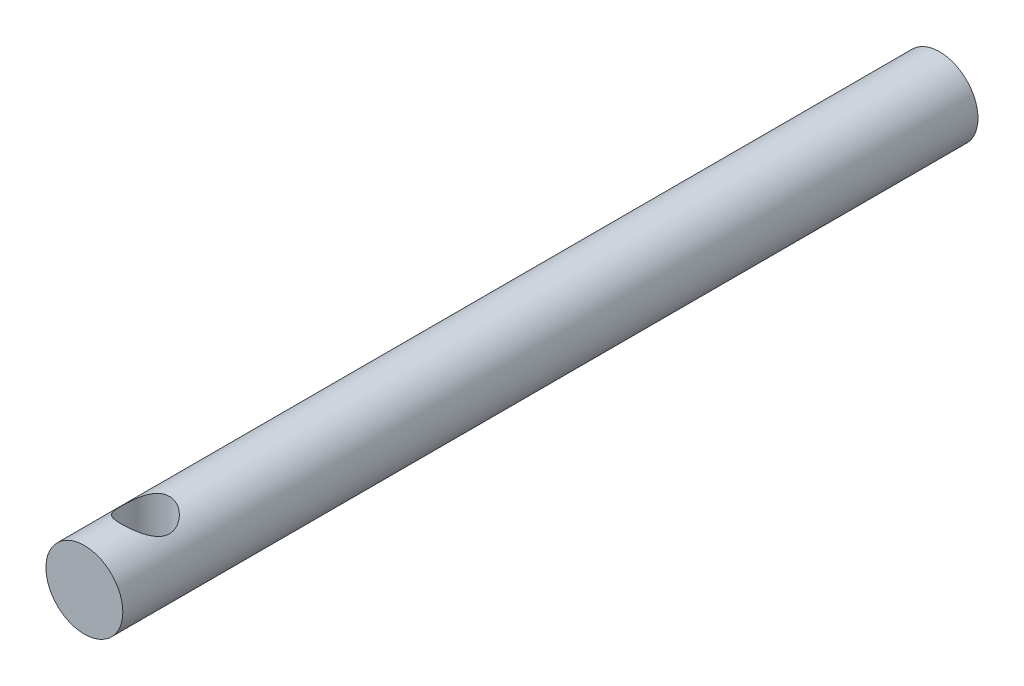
ISO-10303-21;
HEADER;
FILE_DESCRIPTION(('STEP AP214'),'2;1');
FILE_NAME('part.step','',(''),(''),'','','');
FILE_SCHEMA(('AUTOMOTIVE_DESIGN { 1 0 10303 214 1 1 1 1 }'));
ENDSEC;
DATA;
#1=APPLICATION_CONTEXT('core data for automotive mechanical design processes');
#2=APPLICATION_PROTOCOL_DEFINITION('international standard','automotive_design',2000,#1);
#3=PRODUCT_CONTEXT('',#1,'mechanical');
#4=PRODUCT('Part','Part','',(#3));
#5=PRODUCT_RELATED_PRODUCT_CATEGORY('part','',(#4));
#6=PRODUCT_DEFINITION_FORMATION('','',#4);
#7=PRODUCT_DEFINITION_CONTEXT('part definition',#1,'design');
#8=PRODUCT_DEFINITION('design','',#6,#7);
#9=PRODUCT_DEFINITION_SHAPE('','',#8);
#10=(LENGTH_UNIT() NAMED_UNIT(*) SI_UNIT(.MILLI.,.METRE.));
#11=(NAMED_UNIT(*) PLANE_ANGLE_UNIT() SI_UNIT($,.RADIAN.));
#12=(NAMED_UNIT(*) SI_UNIT($,.STERADIAN.) SOLID_ANGLE_UNIT());
#13=UNCERTAINTY_MEASURE_WITH_UNIT(LENGTH_MEASURE(1.E-05),#10,'distance_accuracy_value','');
#14=(GEOMETRIC_REPRESENTATION_CONTEXT(3) GLOBAL_UNCERTAINTY_ASSIGNED_CONTEXT((#13)) GLOBAL_UNIT_ASSIGNED_CONTEXT((#10,
#11,#12)) REPRESENTATION_CONTEXT('',''));
#15=CARTESIAN_POINT('',(0.,0.,0.));
#16=DIRECTION('',(0.,0.,1.));
#17=DIRECTION('',(1.,0.,0.));
#18=AXIS2_PLACEMENT_3D('',#15,#16,#17);
#19=CARTESIAN_POINT('',(0.,0.,0.));
#20=DIRECTION('',(0.,0.,1.));
#21=DIRECTION('',(1.,0.,0.));
#22=AXIS2_PLACEMENT_3D('',#19,#20,#21);
#23=PLANE('',#22);
#24=CARTESIAN_POINT('',(0.,0.,0.));
#25=DIRECTION('',(0.,0.,1.));
#26=DIRECTION('',(1.,0.,0.));
#27=AXIS2_PLACEMENT_3D('',#24,#25,#26);
#28=CIRCLE('',#27,4.);
#29=CARTESIAN_POINT('',(4.,0.,0.));
#30=VERTEX_POINT('',#29);
#31=EDGE_CURVE('E44',#30,#30,#28,.T.);
#32=ORIENTED_EDGE('',*,*,#31,.F.);
#33=EDGE_LOOP('',(#32));
#34=FACE_BOUND('',#33,.T.);
#35=CARTESIAN_POINT('',(0.,0.,0.));
#36=DIRECTION('',(0.,0.,-1.));
#37=DIRECTION('',(-1.,0.,0.));
#38=AXIS2_PLACEMENT_3D('',#35,#36,#37);
#39=CIRCLE('',#38,2.99999999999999);
#40=CARTESIAN_POINT('',(-2.99999999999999,0.,0.));
#41=VERTEX_POINT('',#40);
#42=EDGE_CURVE('E59',#41,#41,#39,.T.);
#43=ORIENTED_EDGE('',*,*,#42,.F.);
#44=EDGE_LOOP('',(#43));
#45=FACE_BOUND('',#44,.T.);
#46=ADVANCED_FACE('F32',(#34,#45),#23,.F.);
#47=CARTESIAN_POINT('',(0.,0.,89.));
#48=DIRECTION('',(0.,0.,-1.));
#49=DIRECTION('',(-1.,0.,0.));
#50=AXIS2_PLACEMENT_3D('',#47,#48,#49);
#51=CYLINDRICAL_SURFACE('',#50,4.);
#52=CARTESIAN_POINT('',(0.,-4.,85.15));
#53=CARTESIAN_POINT('',(0.127017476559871,-3.99999041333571,85.1499895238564));
#54=CARTESIAN_POINT('',(0.254191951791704,-3.9938860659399,85.1402535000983));
#55=CARTESIAN_POINT('',(0.504637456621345,-3.97004375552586,85.1018288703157));
#56=CARTESIAN_POINT('',(0.627900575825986,-3.95228361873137,85.0731041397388));
#57=CARTESIAN_POINT('',(0.86641086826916,-3.90691695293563,84.9983771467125));
#58=CARTESIAN_POINT('',(0.981694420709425,-3.87935918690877,84.9524603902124));
#59=CARTESIAN_POINT('',(1.20252080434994,-3.81669199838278,84.8452283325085));
#60=CARTESIAN_POINT('',(1.30806471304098,-3.7815834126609,84.7839147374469));
#61=CARTESIAN_POINT('',(1.51594836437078,-3.70340304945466,84.6422268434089));
#62=CARTESIAN_POINT('',(1.61735911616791,-3.65991924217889,84.5607213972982));
#63=CARTESIAN_POINT('',(1.80597275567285,-3.57062700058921,84.3835616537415));
#64=CARTESIAN_POINT('',(1.89315621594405,-3.52481549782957,84.2878883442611));
#65=CARTESIAN_POINT('',(2.06285746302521,-3.42860837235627,84.0699322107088));
#66=CARTESIAN_POINT('',(2.14314412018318,-3.37843221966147,83.9458004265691));
#67=CARTESIAN_POINT('',(2.28147932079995,-3.28660396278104,83.6828703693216));
#68=CARTESIAN_POINT('',(2.33956541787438,-3.2449375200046,83.544097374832));
#69=CARTESIAN_POINT('',(2.41866801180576,-3.18619151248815,83.2923789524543));
#70=CARTESIAN_POINT('',(2.44539104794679,-3.16553811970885,83.1820663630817));
#71=CARTESIAN_POINT('',(2.4836368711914,-3.1356271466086,82.9573881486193));
#72=CARTESIAN_POINT('',(2.49518112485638,-3.12635347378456,82.8430284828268));
#73=CARTESIAN_POINT('',(2.50237836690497,-3.12059771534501,82.6131739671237));
#74=CARTESIAN_POINT('',(2.49798968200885,-3.12414917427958,82.4976769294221));
#75=CARTESIAN_POINT('',(2.47352633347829,-3.14354804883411,82.2693797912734));
#76=CARTESIAN_POINT('',(2.4534390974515,-3.15940531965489,82.1565819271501));
#77=CARTESIAN_POINT('',(2.39936209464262,-3.20065145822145,81.9391231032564));
#78=CARTESIAN_POINT('',(2.36570043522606,-3.2258142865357,81.8343351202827));
#79=CARTESIAN_POINT('',(2.28580369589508,-3.28291134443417,81.6316776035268));
#80=CARTESIAN_POINT('',(2.23956416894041,-3.31484796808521,81.5338105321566));
#81=CARTESIAN_POINT('',(2.12589830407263,-3.38909625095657,81.3283335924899));
#82=CARTESIAN_POINT('',(2.05612773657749,-3.43223155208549,81.2223189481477));
#83=CARTESIAN_POINT('',(1.9017611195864,-3.52011451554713,81.0223388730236));
#84=CARTESIAN_POINT('',(1.81714983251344,-3.56486379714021,80.9283859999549));
#85=CARTESIAN_POINT('',(1.61904732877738,-3.65959667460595,80.7393989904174));
#86=CARTESIAN_POINT('',(1.50309447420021,-3.70922571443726,80.6467440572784));
#87=CARTESIAN_POINT('',(1.25426444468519,-3.80056601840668,80.482288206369));
#88=CARTESIAN_POINT('',(1.12139395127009,-3.84228039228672,80.4104790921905));
#89=CARTESIAN_POINT('',(0.915775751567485,-3.89435975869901,80.322654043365));
#90=CARTESIAN_POINT('',(0.848193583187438,-3.90966874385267,80.2971657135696));
#91=CARTESIAN_POINT('',(0.71049204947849,-3.93701839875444,80.2519923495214));
#92=CARTESIAN_POINT('',(0.640374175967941,-3.94906095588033,80.2323039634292));
#93=CARTESIAN_POINT('',(0.49823901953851,-3.96949699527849,80.1990658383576));
#94=CARTESIAN_POINT('',(0.426223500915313,-3.97789374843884,80.185510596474));
#95=CARTESIAN_POINT('',(0.280965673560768,-3.9907876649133,80.1647537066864));
#96=CARTESIAN_POINT('',(0.207723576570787,-3.99528549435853,80.1575509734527));
#97=CARTESIAN_POINT('',(0.00911917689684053,-4.00193773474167,80.1468906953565));
#98=CARTESIAN_POINT('',(-0.11678201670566,-4.000238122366,80.1495996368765));
#99=CARTESIAN_POINT('',(-0.365967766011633,-3.98518313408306,80.1737596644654));
#100=CARTESIAN_POINT('',(-0.489252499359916,-3.97182855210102,80.1952094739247));
#101=CARTESIAN_POINT('',(-0.725036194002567,-3.9354797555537,80.2544785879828));
#102=CARTESIAN_POINT('',(-0.837768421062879,-3.91288306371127,80.2916247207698));
#103=CARTESIAN_POINT('',(-1.05527816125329,-3.85991402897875,80.3805923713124));
#104=CARTESIAN_POINT('',(-1.16005433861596,-3.82954038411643,80.4324163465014));
#105=CARTESIAN_POINT('',(-1.37016761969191,-3.75980014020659,80.5550305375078));
#106=CARTESIAN_POINT('',(-1.47449380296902,-3.71983526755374,80.627207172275));
#107=CARTESIAN_POINT('',(-1.6702854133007,-3.63613942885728,80.7855876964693));
#108=CARTESIAN_POINT('',(-1.76173634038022,-3.59240430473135,80.8718071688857));
#109=CARTESIAN_POINT('',(-1.94294835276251,-3.4981173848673,81.0702700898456));
#110=CARTESIAN_POINT('',(-2.03053702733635,-3.44749766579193,81.1844744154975));
#111=CARTESIAN_POINT('',(-2.18560704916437,-3.35133525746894,81.4277515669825));
#112=CARTESIAN_POINT('',(-2.25310231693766,-3.3057890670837,81.5568140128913));
#113=CARTESIAN_POINT('',(-2.35369543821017,-3.2346706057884,81.7993842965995));
#114=CARTESIAN_POINT('',(-2.39103791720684,-3.20691272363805,81.9104815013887));
#115=CARTESIAN_POINT('',(-2.45000216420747,-3.16210061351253,82.1387862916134));
#116=CARTESIAN_POINT('',(-2.47164849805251,-3.14502966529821,82.2559840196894));
#117=CARTESIAN_POINT('',(-2.49802767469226,-3.124126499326,82.4941805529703));
#118=CARTESIAN_POINT('',(-2.50266374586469,-3.12037003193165,82.6151971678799));
#119=CARTESIAN_POINT('',(-2.49439556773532,-3.12698126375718,82.8562619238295));
#120=CARTESIAN_POINT('',(-2.48148548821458,-3.13735365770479,82.9763097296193));
#121=CARTESIAN_POINT('',(-2.44076547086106,-3.16910777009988,83.2020595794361));
#122=CARTESIAN_POINT('',(-2.41423847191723,-3.18953614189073,83.3081385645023));
#123=CARTESIAN_POINT('',(-2.34835238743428,-3.23835062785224,83.5142701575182));
#124=CARTESIAN_POINT('',(-2.30898795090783,-3.26674005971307,83.6143202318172));
#125=CARTESIAN_POINT('',(-2.21205415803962,-3.3332779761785,83.8211933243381));
#126=CARTESIAN_POINT('',(-2.15267427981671,-3.37224428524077,83.9268999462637));
#127=CARTESIAN_POINT('',(-2.01999894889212,-3.45335445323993,84.1278773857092));
#128=CARTESIAN_POINT('',(-1.9466922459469,-3.49550086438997,84.223139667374));
#129=CARTESIAN_POINT('',(-1.77134669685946,-3.58803675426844,84.4200255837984));
#130=CARTESIAN_POINT('',(-1.66649284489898,-3.63840488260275,84.5191697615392));
#131=CARTESIAN_POINT('',(-1.43961937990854,-3.73398053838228,84.699001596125));
#132=CARTESIAN_POINT('',(-1.31758921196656,-3.77918486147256,84.7796778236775));
#133=CARTESIAN_POINT('',(-1.12346357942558,-3.83959214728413,84.8845634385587));
#134=CARTESIAN_POINT('',(-1.05679601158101,-3.85851834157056,84.916874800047));
#135=CARTESIAN_POINT('',(-0.920199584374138,-3.8933516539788,84.9756722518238));
#136=CARTESIAN_POINT('',(-0.850272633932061,-3.90926051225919,85.0021617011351));
#137=CARTESIAN_POINT('',(-0.707873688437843,-3.93753374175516,85.0488571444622));
#138=CARTESIAN_POINT('',(-0.635409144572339,-3.94990764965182,85.0690800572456));
#139=CARTESIAN_POINT('',(-0.488456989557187,-3.97075677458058,85.1029754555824));
#140=CARTESIAN_POINT('',(-0.413970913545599,-3.97923486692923,85.1166527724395));
#141=CARTESIAN_POINT('',(-0.282852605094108,-3.99038271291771,85.1345904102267));
#142=CARTESIAN_POINT('',(-0.226501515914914,-3.99398159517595,85.1403615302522));
#143=CARTESIAN_POINT('',(-0.113444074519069,-3.99879245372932,85.1480687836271));
#144=CARTESIAN_POINT('',(-0.0567377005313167,-4.00000428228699,85.1500046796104));
#145=CARTESIAN_POINT('',(0.,-4.,85.15));
#146=B_SPLINE_CURVE_WITH_KNOTS('',3,(#52,#53,#54,#55,#56,#57,#58,#59,#60,#61,#62,#63,#64,#65,
#66,#67,#68,#69,#70,#71,#72,#73,#74,#75,#76,#77,#78,#79,#80,#81,#82,#83,#84,#85,#86,#87,#88,#89,
#90,#91,#92,#93,#94,#95,#96,#97,#98,#99,#100,#101,#102,#103,#104,#105,#106,#107,#108,#109,#110,
#111,#112,#113,#114,#115,#116,#117,#118,#119,#120,#121,#122,#123,#124,#125,#126,#127,#128,#129,
#130,#131,#132,#133,#134,#135,#136,#137,#138,#139,#140,#141,#142,#143,#144,#145),.UNSPECIFIED.,
.T.,.F.,(4,2,2,2,2,2,2,2,2,2,2,2,2,2,2,2,2,2,2,2,2,2,2,2,2,2,2,2,2,2,2,2,2,2,2,2,2,2,2,2,2,2,2,
2,2,2,4),(0.,0.380824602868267,0.762375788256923,1.14205397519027,1.52169010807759,
1.93164374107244,2.34215256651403,2.80825951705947,3.27357449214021,3.61824017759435,
3.9624178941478,4.30749646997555,4.65285169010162,4.99031678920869,5.32790135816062,
5.72854900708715,6.12961045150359,6.59684361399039,7.06389281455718,7.28510978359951,
7.50619865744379,7.72708876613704,7.9479411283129,8.32363778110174,8.69930884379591,
9.06028425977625,9.42132014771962,9.81879878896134,10.216721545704,10.6724083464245,
11.1277787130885,11.4876929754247,11.8470427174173,12.2084336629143,12.5699447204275,
12.9023575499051,13.2349091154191,13.6156046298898,13.9966089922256,14.4531049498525,
14.9098826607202,15.138984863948,15.3679545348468,15.5963005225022,15.8244777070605,
15.994578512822,16.1646898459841),.UNSPECIFIED.);
#147=CARTESIAN_POINT('',(0.,-4.,85.15));
#148=VERTEX_POINT('',#147);
#149=EDGE_CURVE('E37',#148,#148,#146,.T.);
#150=ORIENTED_EDGE('',*,*,#149,.T.);
#151=EDGE_LOOP('',(#150));
#152=FACE_BOUND('',#151,.T.);
#153=CARTESIAN_POINT('',(0.,4.,85.15));
#154=CARTESIAN_POINT('',(-0.127017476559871,3.99999041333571,85.1499895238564));
#155=CARTESIAN_POINT('',(-0.254191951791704,3.9938860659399,85.1402535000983));
#156=CARTESIAN_POINT('',(-0.504637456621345,3.97004375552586,85.1018288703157));
#157=CARTESIAN_POINT('',(-0.627900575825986,3.95228361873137,85.0731041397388));
#158=CARTESIAN_POINT('',(-0.86641086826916,3.90691695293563,84.9983771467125));
#159=CARTESIAN_POINT('',(-0.981694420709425,3.87935918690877,84.9524603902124));
#160=CARTESIAN_POINT('',(-1.20252080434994,3.81669199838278,84.8452283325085));
#161=CARTESIAN_POINT('',(-1.30806471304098,3.7815834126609,84.7839147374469));
#162=CARTESIAN_POINT('',(-1.51594836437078,3.70340304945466,84.6422268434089));
#163=CARTESIAN_POINT('',(-1.61735911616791,3.65991924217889,84.5607213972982));
#164=CARTESIAN_POINT('',(-1.80597275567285,3.57062700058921,84.3835616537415));
#165=CARTESIAN_POINT('',(-1.89315621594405,3.52481549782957,84.2878883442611));
#166=CARTESIAN_POINT('',(-2.06285746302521,3.42860837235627,84.0699322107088));
#167=CARTESIAN_POINT('',(-2.14314412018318,3.37843221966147,83.9458004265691));
#168=CARTESIAN_POINT('',(-2.28147932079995,3.28660396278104,83.6828703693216));
#169=CARTESIAN_POINT('',(-2.33956541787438,3.2449375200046,83.544097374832));
#170=CARTESIAN_POINT('',(-2.41866801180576,3.18619151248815,83.2923789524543));
#171=CARTESIAN_POINT('',(-2.44539104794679,3.16553811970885,83.1820663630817));
#172=CARTESIAN_POINT('',(-2.4836368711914,3.1356271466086,82.9573881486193));
#173=CARTESIAN_POINT('',(-2.49518112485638,3.12635347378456,82.8430284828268));
#174=CARTESIAN_POINT('',(-2.50237836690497,3.12059771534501,82.6131739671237));
#175=CARTESIAN_POINT('',(-2.49798968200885,3.12414917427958,82.4976769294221));
#176=CARTESIAN_POINT('',(-2.47352633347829,3.14354804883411,82.2693797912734));
#177=CARTESIAN_POINT('',(-2.4534390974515,3.15940531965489,82.1565819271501));
#178=CARTESIAN_POINT('',(-2.39936209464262,3.20065145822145,81.9391231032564));
#179=CARTESIAN_POINT('',(-2.36570043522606,3.2258142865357,81.8343351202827));
#180=CARTESIAN_POINT('',(-2.28580369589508,3.28291134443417,81.6316776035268));
#181=CARTESIAN_POINT('',(-2.23956416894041,3.31484796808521,81.5338105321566));
#182=CARTESIAN_POINT('',(-2.12589830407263,3.38909625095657,81.3283335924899));
#183=CARTESIAN_POINT('',(-2.05612773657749,3.43223155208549,81.2223189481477));
#184=CARTESIAN_POINT('',(-1.9017611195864,3.52011451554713,81.0223388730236));
#185=CARTESIAN_POINT('',(-1.81714983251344,3.56486379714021,80.9283859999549));
#186=CARTESIAN_POINT('',(-1.61904732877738,3.65959667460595,80.7393989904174));
#187=CARTESIAN_POINT('',(-1.50309447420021,3.70922571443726,80.6467440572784));
#188=CARTESIAN_POINT('',(-1.25426444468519,3.80056601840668,80.482288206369));
#189=CARTESIAN_POINT('',(-1.12139395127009,3.84228039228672,80.4104790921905));
#190=CARTESIAN_POINT('',(-0.915775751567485,3.89435975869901,80.322654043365));
#191=CARTESIAN_POINT('',(-0.848193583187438,3.90966874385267,80.2971657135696));
#192=CARTESIAN_POINT('',(-0.71049204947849,3.93701839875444,80.2519923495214));
#193=CARTESIAN_POINT('',(-0.640374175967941,3.94906095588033,80.2323039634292));
#194=CARTESIAN_POINT('',(-0.49823901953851,3.96949699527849,80.1990658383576));
#195=CARTESIAN_POINT('',(-0.426223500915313,3.97789374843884,80.185510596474));
#196=CARTESIAN_POINT('',(-0.280965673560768,3.9907876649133,80.1647537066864));
#197=CARTESIAN_POINT('',(-0.207723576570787,3.99528549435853,80.1575509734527));
#198=CARTESIAN_POINT('',(-0.00911917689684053,4.00193773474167,80.1468906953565));
#199=CARTESIAN_POINT('',(0.11678201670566,4.000238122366,80.1495996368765));
#200=CARTESIAN_POINT('',(0.365967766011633,3.98518313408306,80.1737596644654));
#201=CARTESIAN_POINT('',(0.489252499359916,3.97182855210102,80.1952094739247));
#202=CARTESIAN_POINT('',(0.725036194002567,3.9354797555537,80.2544785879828));
#203=CARTESIAN_POINT('',(0.837768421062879,3.91288306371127,80.2916247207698));
#204=CARTESIAN_POINT('',(1.05527816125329,3.85991402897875,80.3805923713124));
#205=CARTESIAN_POINT('',(1.16005433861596,3.82954038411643,80.4324163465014));
#206=CARTESIAN_POINT('',(1.37016761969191,3.75980014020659,80.5550305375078));
#207=CARTESIAN_POINT('',(1.47449380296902,3.71983526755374,80.627207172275));
#208=CARTESIAN_POINT('',(1.6702854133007,3.63613942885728,80.7855876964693));
#209=CARTESIAN_POINT('',(1.76173634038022,3.59240430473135,80.8718071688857));
#210=CARTESIAN_POINT('',(1.94294835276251,3.4981173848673,81.0702700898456));
#211=CARTESIAN_POINT('',(2.03053702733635,3.44749766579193,81.1844744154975));
#212=CARTESIAN_POINT('',(2.18560704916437,3.35133525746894,81.4277515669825));
#213=CARTESIAN_POINT('',(2.25310231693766,3.3057890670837,81.5568140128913));
#214=CARTESIAN_POINT('',(2.35369543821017,3.2346706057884,81.7993842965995));
#215=CARTESIAN_POINT('',(2.39103791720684,3.20691272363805,81.9104815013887));
#216=CARTESIAN_POINT('',(2.45000216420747,3.16210061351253,82.1387862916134));
#217=CARTESIAN_POINT('',(2.47164849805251,3.14502966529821,82.2559840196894));
#218=CARTESIAN_POINT('',(2.49802767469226,3.124126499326,82.4941805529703));
#219=CARTESIAN_POINT('',(2.50266374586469,3.12037003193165,82.6151971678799));
#220=CARTESIAN_POINT('',(2.49439556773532,3.12698126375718,82.8562619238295));
#221=CARTESIAN_POINT('',(2.48148548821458,3.13735365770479,82.9763097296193));
#222=CARTESIAN_POINT('',(2.44076547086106,3.16910777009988,83.2020595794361));
#223=CARTESIAN_POINT('',(2.41423847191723,3.18953614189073,83.3081385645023));
#224=CARTESIAN_POINT('',(2.34835238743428,3.23835062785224,83.5142701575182));
#225=CARTESIAN_POINT('',(2.30898795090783,3.26674005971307,83.6143202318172));
#226=CARTESIAN_POINT('',(2.21205415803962,3.3332779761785,83.8211933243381));
#227=CARTESIAN_POINT('',(2.15267427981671,3.37224428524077,83.9268999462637));
#228=CARTESIAN_POINT('',(2.01999894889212,3.45335445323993,84.1278773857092));
#229=CARTESIAN_POINT('',(1.9466922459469,3.49550086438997,84.223139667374));
#230=CARTESIAN_POINT('',(1.77134669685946,3.58803675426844,84.4200255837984));
#231=CARTESIAN_POINT('',(1.66649284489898,3.63840488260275,84.5191697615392));
#232=CARTESIAN_POINT('',(1.43961937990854,3.73398053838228,84.699001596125));
#233=CARTESIAN_POINT('',(1.31758921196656,3.77918486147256,84.7796778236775));
#234=CARTESIAN_POINT('',(1.12346357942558,3.83959214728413,84.8845634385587));
#235=CARTESIAN_POINT('',(1.05679601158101,3.85851834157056,84.916874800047));
#236=CARTESIAN_POINT('',(0.920199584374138,3.8933516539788,84.9756722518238));
#237=CARTESIAN_POINT('',(0.850272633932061,3.90926051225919,85.0021617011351));
#238=CARTESIAN_POINT('',(0.707873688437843,3.93753374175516,85.0488571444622));
#239=CARTESIAN_POINT('',(0.635409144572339,3.94990764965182,85.0690800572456));
#240=CARTESIAN_POINT('',(0.488456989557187,3.97075677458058,85.1029754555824));
#241=CARTESIAN_POINT('',(0.413970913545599,3.97923486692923,85.1166527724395));
#242=CARTESIAN_POINT('',(0.282852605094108,3.99038271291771,85.1345904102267));
#243=CARTESIAN_POINT('',(0.226501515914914,3.99398159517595,85.1403615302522));
#244=CARTESIAN_POINT('',(0.113444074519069,3.99879245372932,85.1480687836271));
#245=CARTESIAN_POINT('',(0.0567377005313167,4.00000428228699,85.1500046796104));
#246=CARTESIAN_POINT('',(0.,4.,85.15));
#247=B_SPLINE_CURVE_WITH_KNOTS('',3,(#153,#154,#155,#156,#157,#158,#159,#160,#161,#162,#163,
#164,#165,#166,#167,#168,#169,#170,#171,#172,#173,#174,#175,#176,#177,#178,#179,#180,#181,#182,
#183,#184,#185,#186,#187,#188,#189,#190,#191,#192,#193,#194,#195,#196,#197,#198,#199,#200,#201,
#202,#203,#204,#205,#206,#207,#208,#209,#210,#211,#212,#213,#214,#215,#216,#217,#218,#219,#220,
#221,#222,#223,#224,#225,#226,#227,#228,#229,#230,#231,#232,#233,#234,#235,#236,#237,#238,#239,
#240,#241,#242,#243,#244,#245,#246),.UNSPECIFIED.,.T.,.F.,(4,2,2,2,2,2,2,2,2,2,2,2,2,2,2,2,2,2,
2,2,2,2,2,2,2,2,2,2,2,2,2,2,2,2,2,2,2,2,2,2,2,2,2,2,2,2,4),(0.,0.380824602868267,
0.762375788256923,1.14205397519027,1.52169010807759,1.93164374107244,2.34215256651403,
2.80825951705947,3.27357449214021,3.61824017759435,3.9624178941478,4.30749646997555,
4.65285169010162,4.99031678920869,5.32790135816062,5.72854900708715,6.12961045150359,
6.59684361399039,7.06389281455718,7.28510978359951,7.50619865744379,7.72708876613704,
7.9479411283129,8.32363778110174,8.69930884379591,9.06028425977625,9.42132014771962,
9.81879878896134,10.216721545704,10.6724083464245,11.1277787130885,11.4876929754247,
11.8470427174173,12.2084336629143,12.5699447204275,12.9023575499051,13.2349091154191,
13.6156046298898,13.9966089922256,14.4531049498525,14.9098826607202,15.138984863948,
15.3679545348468,15.5963005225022,15.8244777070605,15.994578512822,16.1646898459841),.UNSPECIFIED.);
#248=CARTESIAN_POINT('',(0.,4.,85.15));
#249=VERTEX_POINT('',#248);
#250=EDGE_CURVE('E58',#249,#249,#247,.T.);
#251=ORIENTED_EDGE('',*,*,#250,.T.);
#252=EDGE_LOOP('',(#251));
#253=FACE_BOUND('',#252,.T.);
#254=CARTESIAN_POINT('',(0.,0.,89.));
#255=DIRECTION('',(0.,0.,1.));
#256=DIRECTION('',(1.,0.,0.));
#257=AXIS2_PLACEMENT_3D('',#254,#255,#256);
#258=CIRCLE('',#257,4.);
#259=CARTESIAN_POINT('',(4.,0.,89.));
#260=VERTEX_POINT('',#259);
#261=EDGE_CURVE('E11',#260,#260,#258,.T.);
#262=ORIENTED_EDGE('',*,*,#261,.F.);
#263=EDGE_LOOP('',(#262));
#264=FACE_BOUND('',#263,.T.);
#265=ORIENTED_EDGE('',*,*,#31,.T.);
#266=EDGE_LOOP('',(#265));
#267=FACE_BOUND('',#266,.T.);
#268=ADVANCED_FACE('F34',(#152,#253,#264,#267),#51,.T.);
#269=CARTESIAN_POINT('',(0.,0.,89.));
#270=DIRECTION('',(0.,0.,1.));
#271=DIRECTION('',(1.,0.,0.));
#272=AXIS2_PLACEMENT_3D('',#269,#270,#271);
#273=PLANE('',#272);
#274=ORIENTED_EDGE('',*,*,#261,.T.);
#275=EDGE_LOOP('',(#274));
#276=FACE_BOUND('',#275,.T.);
#277=ADVANCED_FACE('F71',(#276),#273,.T.);
#278=CARTESIAN_POINT('',(0.,-44.5,82.65));
#279=DIRECTION('',(0.,1.,0.));
#280=DIRECTION('',(0.,0.,1.));
#281=AXIS2_PLACEMENT_3D('',#278,#279,#280);
#282=CYLINDRICAL_SURFACE('',#281,2.5);
#283=ORIENTED_EDGE('',*,*,#250,.F.);
#284=EDGE_LOOP('',(#283));
#285=FACE_BOUND('',#284,.T.);
#286=ORIENTED_EDGE('',*,*,#149,.F.);
#287=EDGE_LOOP('',(#286));
#288=FACE_BOUND('',#287,.T.);
#289=ADVANCED_FACE('F52',(#285,#288),#282,.F.);
#290=CARTESIAN_POINT('',(0.,0.,30.));
#291=DIRECTION('',(0.,0.,-1.));
#292=DIRECTION('',(-1.,0.,0.));
#293=AXIS2_PLACEMENT_3D('',#290,#291,#292);
#294=CONICAL_SURFACE('',#293,2.99999999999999,1.02974425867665);
#295=CARTESIAN_POINT('',(0.,0.,31.8025818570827));
#296=VERTEX_POINT('',#295);
#297=VERTEX_LOOP('',#296);
#298=FACE_BOUND('',#297,.T.);
#299=CARTESIAN_POINT('',(0.,0.,30.));
#300=DIRECTION('',(0.,0.,-1.));
#301=DIRECTION('',(-1.,0.,0.));
#302=AXIS2_PLACEMENT_3D('',#299,#300,#301);
#303=CIRCLE('',#302,2.99999999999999);
#304=CARTESIAN_POINT('',(-2.99999999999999,0.,30.));
#305=VERTEX_POINT('',#304);
#306=EDGE_CURVE('E56',#305,#305,#303,.T.);
#307=ORIENTED_EDGE('',*,*,#306,.T.);
#308=EDGE_LOOP('',(#307));
#309=FACE_BOUND('',#308,.T.);
#310=ADVANCED_FACE('F48',(#298,#309),#294,.F.);
#311=CARTESIAN_POINT('',(0.,0.,0.));
#312=DIRECTION('',(0.,0.,-1.));
#313=DIRECTION('',(-1.,0.,0.));
#314=AXIS2_PLACEMENT_3D('',#311,#312,#313);
#315=CYLINDRICAL_SURFACE('',#314,2.99999999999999);
#316=ORIENTED_EDGE('',*,*,#306,.F.);
#317=EDGE_LOOP('',(#316));
#318=FACE_BOUND('',#317,.T.);
#319=ORIENTED_EDGE('',*,*,#42,.T.);
#320=EDGE_LOOP('',(#319));
#321=FACE_BOUND('',#320,.T.);
#322=ADVANCED_FACE('F51',(#318,#321),#315,.F.);
#323=CLOSED_SHELL('',(#46,#268,#277,#289,#310,#322));
#324=MANIFOLD_SOLID_BREP('B2',#323);
#325=ADVANCED_BREP_SHAPE_REPRESENTATION('',(#18,#324),#14);
#326=SHAPE_DEFINITION_REPRESENTATION(#9,#325);
ENDSEC;
END-ISO-10303-21;
